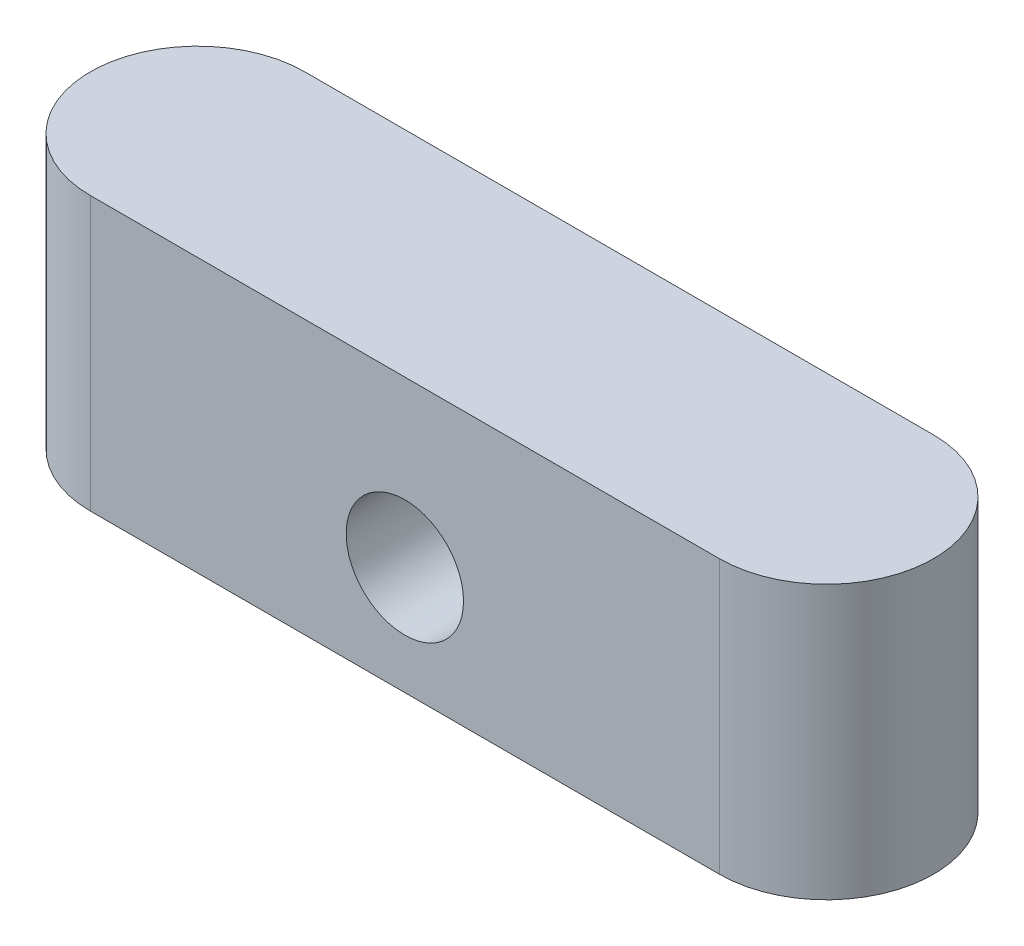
ISO-10303-21;
HEADER;
FILE_DESCRIPTION(('STEP AP214'),'2;1');
FILE_NAME('part.step','',(''),(''),'','','');
FILE_SCHEMA(('AUTOMOTIVE_DESIGN { 1 0 10303 214 1 1 1 1 }'));
ENDSEC;
DATA;
#1=APPLICATION_CONTEXT('core data for automotive mechanical design processes');
#2=APPLICATION_PROTOCOL_DEFINITION('international standard','automotive_design',2000,#1);
#3=PRODUCT_CONTEXT('',#1,'mechanical');
#4=PRODUCT('Part','Part','',(#3));
#5=PRODUCT_RELATED_PRODUCT_CATEGORY('part','',(#4));
#6=PRODUCT_DEFINITION_FORMATION('','',#4);
#7=PRODUCT_DEFINITION_CONTEXT('part definition',#1,'design');
#8=PRODUCT_DEFINITION('design','',#6,#7);
#9=PRODUCT_DEFINITION_SHAPE('','',#8);
#10=(LENGTH_UNIT() NAMED_UNIT(*) SI_UNIT(.MILLI.,.METRE.));
#11=(NAMED_UNIT(*) PLANE_ANGLE_UNIT() SI_UNIT($,.RADIAN.));
#12=(NAMED_UNIT(*) SI_UNIT($,.STERADIAN.) SOLID_ANGLE_UNIT());
#13=UNCERTAINTY_MEASURE_WITH_UNIT(LENGTH_MEASURE(1.E-05),#10,'distance_accuracy_value','');
#14=(GEOMETRIC_REPRESENTATION_CONTEXT(3) GLOBAL_UNCERTAINTY_ASSIGNED_CONTEXT((#13)) GLOBAL_UNIT_ASSIGNED_CONTEXT((#10,
#11,#12)) REPRESENTATION_CONTEXT('',''));
#15=CARTESIAN_POINT('',(0.,0.,0.));
#16=DIRECTION('',(0.,0.,1.));
#17=DIRECTION('',(1.,0.,0.));
#18=AXIS2_PLACEMENT_3D('',#15,#16,#17);
#19=CARTESIAN_POINT('',(-7.25,3.15,0.));
#20=DIRECTION('',(0.,-1.,0.));
#21=DIRECTION('',(0.,0.,-1.));
#22=AXIS2_PLACEMENT_3D('',#19,#20,#21);
#23=CYLINDRICAL_SURFACE('',#22,2.47015);
#24=CARTESIAN_POINT('',(-7.25,-3.15,0.));
#25=DIRECTION('',(0.,1.,0.));
#26=DIRECTION('',(0.,0.,1.));
#27=AXIS2_PLACEMENT_3D('',#24,#25,#26);
#28=CIRCLE('',#27,2.47015);
#29=CARTESIAN_POINT('',(-7.25,-3.15,-2.47015));
#30=VERTEX_POINT('',#29);
#31=CARTESIAN_POINT('',(-7.25,-3.15,2.47015));
#32=VERTEX_POINT('',#31);
#33=EDGE_CURVE('E97',#30,#32,#28,.T.);
#34=ORIENTED_EDGE('',*,*,#33,.T.);
#35=DIRECTION('',(0.,-1.,0.));
#36=VECTOR('',#35,1.);
#37=CARTESIAN_POINT('',(-7.25,3.15,2.47015));
#38=LINE('',#37,#36);
#39=CARTESIAN_POINT('',(-7.25,3.15,2.47015));
#40=VERTEX_POINT('',#39);
#41=EDGE_CURVE('E11',#40,#32,#38,.T.);
#42=ORIENTED_EDGE('',*,*,#41,.F.);
#43=CARTESIAN_POINT('',(-7.25,3.15,0.));
#44=DIRECTION('',(0.,1.,0.));
#45=DIRECTION('',(0.,0.,1.));
#46=AXIS2_PLACEMENT_3D('',#43,#44,#45);
#47=CIRCLE('',#46,2.47015);
#48=CARTESIAN_POINT('',(-7.25,3.15,-2.47015));
#49=VERTEX_POINT('',#48);
#50=EDGE_CURVE('E85',#49,#40,#47,.T.);
#51=ORIENTED_EDGE('',*,*,#50,.F.);
#52=DIRECTION('',(0.,-1.,0.));
#53=VECTOR('',#52,1.);
#54=CARTESIAN_POINT('',(-7.25,3.15,-2.47015));
#55=LINE('',#54,#53);
#56=EDGE_CURVE('E93',#49,#30,#55,.T.);
#57=ORIENTED_EDGE('',*,*,#56,.T.);
#58=EDGE_LOOP('',(#34,#42,#51,#57));
#59=FACE_BOUND('',#58,.T.);
#60=ADVANCED_FACE('F34',(#59),#23,.T.);
#61=CARTESIAN_POINT('',(-7.25,3.15,2.47015));
#62=DIRECTION('',(0.,0.,-1.));
#63=DIRECTION('',(-1.,0.,0.));
#64=AXIS2_PLACEMENT_3D('',#61,#62,#63);
#65=PLANE('',#64);
#66=CARTESIAN_POINT('',(0.,-0.65,2.47015));
#67=DIRECTION('',(0.,0.,1.));
#68=DIRECTION('',(1.,0.,0.));
#69=AXIS2_PLACEMENT_3D('',#66,#67,#68);
#70=CIRCLE('',#69,1.35255);
#71=CARTESIAN_POINT('',(1.35255,-0.65,2.47015));
#72=VERTEX_POINT('',#71);
#73=EDGE_CURVE('E113',#72,#72,#70,.T.);
#74=ORIENTED_EDGE('',*,*,#73,.F.);
#75=EDGE_LOOP('',(#74));
#76=FACE_BOUND('',#75,.T.);
#77=DIRECTION('',(1.,0.,0.));
#78=VECTOR('',#77,1.);
#79=CARTESIAN_POINT('',(-7.25,-3.15,2.47015));
#80=LINE('',#79,#78);
#81=CARTESIAN_POINT('',(7.25,-3.15,2.47015));
#82=VERTEX_POINT('',#81);
#83=EDGE_CURVE('E89',#32,#82,#80,.T.);
#84=ORIENTED_EDGE('',*,*,#83,.T.);
#85=DIRECTION('',(0.,-1.,0.));
#86=VECTOR('',#85,1.);
#87=CARTESIAN_POINT('',(7.25,3.15,2.47015));
#88=LINE('',#87,#86);
#89=CARTESIAN_POINT('',(7.25,3.15,2.47015));
#90=VERTEX_POINT('',#89);
#91=EDGE_CURVE('E42',#90,#82,#88,.T.);
#92=ORIENTED_EDGE('',*,*,#91,.F.);
#93=DIRECTION('',(1.,0.,0.));
#94=VECTOR('',#93,1.);
#95=CARTESIAN_POINT('',(-7.25,3.15,2.47015));
#96=LINE('',#95,#94);
#97=EDGE_CURVE('E80',#40,#90,#96,.T.);
#98=ORIENTED_EDGE('',*,*,#97,.F.);
#99=ORIENTED_EDGE('',*,*,#41,.T.);
#100=EDGE_LOOP('',(#84,#92,#98,#99));
#101=FACE_BOUND('',#100,.T.);
#102=ADVANCED_FACE('F88',(#76,#101),#65,.F.);
#103=CARTESIAN_POINT('',(7.25,3.15,0.));
#104=DIRECTION('',(0.,-1.,0.));
#105=DIRECTION('',(0.,0.,-1.));
#106=AXIS2_PLACEMENT_3D('',#103,#104,#105);
#107=CYLINDRICAL_SURFACE('',#106,2.47015);
#108=CARTESIAN_POINT('',(7.25,-3.15,0.));
#109=DIRECTION('',(0.,1.,0.));
#110=DIRECTION('',(0.,0.,1.));
#111=AXIS2_PLACEMENT_3D('',#108,#109,#110);
#112=CIRCLE('',#111,2.47015);
#113=CARTESIAN_POINT('',(7.25,-3.15,-2.47015));
#114=VERTEX_POINT('',#113);
#115=EDGE_CURVE('E67',#82,#114,#112,.T.);
#116=ORIENTED_EDGE('',*,*,#115,.T.);
#117=DIRECTION('',(0.,-1.,0.));
#118=VECTOR('',#117,1.);
#119=CARTESIAN_POINT('',(7.25,3.15,-2.47015));
#120=LINE('',#119,#118);
#121=CARTESIAN_POINT('',(7.25,3.15,-2.47015));
#122=VERTEX_POINT('',#121);
#123=EDGE_CURVE('E90',#122,#114,#120,.T.);
#124=ORIENTED_EDGE('',*,*,#123,.F.);
#125=CARTESIAN_POINT('',(7.25,3.15,0.));
#126=DIRECTION('',(0.,1.,0.));
#127=DIRECTION('',(0.,0.,1.));
#128=AXIS2_PLACEMENT_3D('',#125,#126,#127);
#129=CIRCLE('',#128,2.47015);
#130=EDGE_CURVE('E83',#90,#122,#129,.T.);
#131=ORIENTED_EDGE('',*,*,#130,.F.);
#132=ORIENTED_EDGE('',*,*,#91,.T.);
#133=EDGE_LOOP('',(#116,#124,#131,#132));
#134=FACE_BOUND('',#133,.T.);
#135=ADVANCED_FACE('F91',(#134),#107,.T.);
#136=CARTESIAN_POINT('',(-7.25,3.15,-2.47015));
#137=DIRECTION('',(0.,0.,1.));
#138=DIRECTION('',(1.,0.,0.));
#139=AXIS2_PLACEMENT_3D('',#136,#137,#138);
#140=PLANE('',#139);
#141=CARTESIAN_POINT('',(0.,-0.65,-2.47015));
#142=DIRECTION('',(0.,0.,1.));
#143=DIRECTION('',(1.,0.,0.));
#144=AXIS2_PLACEMENT_3D('',#141,#142,#143);
#145=CIRCLE('',#144,1.35255);
#146=CARTESIAN_POINT('',(1.35255,-0.65,-2.47015));
#147=VERTEX_POINT('',#146);
#148=EDGE_CURVE('E100',#147,#147,#145,.T.);
#149=ORIENTED_EDGE('',*,*,#148,.T.);
#150=EDGE_LOOP('',(#149));
#151=FACE_BOUND('',#150,.T.);
#152=DIRECTION('',(-1.,0.,0.));
#153=VECTOR('',#152,1.);
#154=CARTESIAN_POINT('',(-7.25,-3.15,-2.47015));
#155=LINE('',#154,#153);
#156=EDGE_CURVE('E73',#114,#30,#155,.T.);
#157=ORIENTED_EDGE('',*,*,#156,.T.);
#158=ORIENTED_EDGE('',*,*,#56,.F.);
#159=DIRECTION('',(-1.,0.,0.));
#160=VECTOR('',#159,1.);
#161=CARTESIAN_POINT('',(-7.25,3.15,-2.47015));
#162=LINE('',#161,#160);
#163=EDGE_CURVE('E50',#122,#49,#162,.T.);
#164=ORIENTED_EDGE('',*,*,#163,.F.);
#165=ORIENTED_EDGE('',*,*,#123,.T.);
#166=EDGE_LOOP('',(#157,#158,#164,#165));
#167=FACE_BOUND('',#166,.T.);
#168=ADVANCED_FACE('F105',(#151,#167),#140,.F.);
#169=CARTESIAN_POINT('',(-7.25,3.15,0.));
#170=DIRECTION('',(0.,1.,0.));
#171=DIRECTION('',(0.,0.,1.));
#172=AXIS2_PLACEMENT_3D('',#169,#170,#171);
#173=PLANE('',#172);
#174=ORIENTED_EDGE('',*,*,#50,.T.);
#175=ORIENTED_EDGE('',*,*,#97,.T.);
#176=ORIENTED_EDGE('',*,*,#130,.T.);
#177=ORIENTED_EDGE('',*,*,#163,.T.);
#178=EDGE_LOOP('',(#174,#175,#176,#177));
#179=FACE_BOUND('',#178,.T.);
#180=ADVANCED_FACE('F81',(#179),#173,.T.);
#181=CARTESIAN_POINT('',(-7.25,-3.15,0.));
#182=DIRECTION('',(0.,1.,0.));
#183=DIRECTION('',(0.,0.,1.));
#184=AXIS2_PLACEMENT_3D('',#181,#182,#183);
#185=PLANE('',#184);
#186=ORIENTED_EDGE('',*,*,#33,.F.);
#187=ORIENTED_EDGE('',*,*,#156,.F.);
#188=ORIENTED_EDGE('',*,*,#115,.F.);
#189=ORIENTED_EDGE('',*,*,#83,.F.);
#190=EDGE_LOOP('',(#186,#187,#188,#189));
#191=FACE_BOUND('',#190,.T.);
#192=ADVANCED_FACE('F108',(#191),#185,.F.);
#193=CARTESIAN_POINT('',(0.,-0.65,2.47015));
#194=DIRECTION('',(0.,0.,1.));
#195=DIRECTION('',(1.,0.,0.));
#196=AXIS2_PLACEMENT_3D('',#193,#194,#195);
#197=CYLINDRICAL_SURFACE('',#196,1.35255);
#198=ORIENTED_EDGE('',*,*,#148,.F.);
#199=EDGE_LOOP('',(#198));
#200=FACE_BOUND('',#199,.T.);
#201=ORIENTED_EDGE('',*,*,#73,.T.);
#202=EDGE_LOOP('',(#201));
#203=FACE_BOUND('',#202,.T.);
#204=ADVANCED_FACE('F117',(#200,#203),#197,.F.);
#205=CLOSED_SHELL('',(#60,#102,#135,#168,#180,#192,#204));
#206=MANIFOLD_SOLID_BREP('B2',#205);
#207=ADVANCED_BREP_SHAPE_REPRESENTATION('',(#18,#206),#14);
#208=SHAPE_DEFINITION_REPRESENTATION(#9,#207);
ENDSEC;
END-ISO-10303-21;
